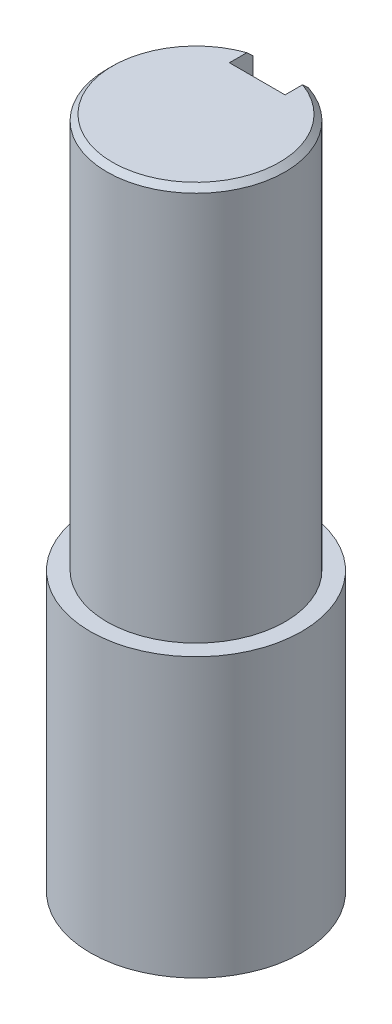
from build123d import *

# Parameters (mm, degrees)
SKETCH1_R           = 16
BOSS_EXTRUDE1_DEPTH = 71
SKETCH2_W           = 10
SKETCH2_H           = 10
CUT_EXTRUDE1_DEPTH  = 66
SKETCH3_R           = 19
BOSS_EXTRUDE2_DEPTH = 50
CHAMFER1_SIZE       = 1


with BuildPart() as part:
    # Sketch1 → Boss-Extrude1 (new body)
    with BuildSketch(Plane(origin=(0, 0, 0), x_dir=(1, 0, 0), z_dir=(0, 1, 0))):
        with Locations(Location((0, 0, 0), (0, 0, 270))):
            Circle(SKETCH1_R)
    extrude(amount=BOSS_EXTRUDE1_DEPTH)

    # Sketch2 → Cut-Extrude1 (cut)
    with BuildSketch(Plane(origin=(0, 71, 0), x_dir=(1, 0, 0), z_dir=(0, 1, 0))):
        with Locations((0, 16)):
            Rectangle(SKETCH2_W, SKETCH2_H)
    extrude(amount=-CUT_EXTRUDE1_DEPTH, mode=Mode.SUBTRACT)

    # Sketch3 → Boss-Extrude2 (add)
    with BuildSketch(Plane.XZ):
        with Locations(Location((0, 0, 0), (0, 0, 270))):
            Circle(SKETCH3_R)
    extrude(amount=BOSS_EXTRUDE2_DEPTH)

    # Chamfer1
    chamfer1_edges = [part.edges().sort_by_distance(p)[0] for p in [
        (15.798400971, 71, 2.531901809),
    ]]
    chamfer(chamfer1_edges, length=CHAMFER1_SIZE)


solid = part.part
